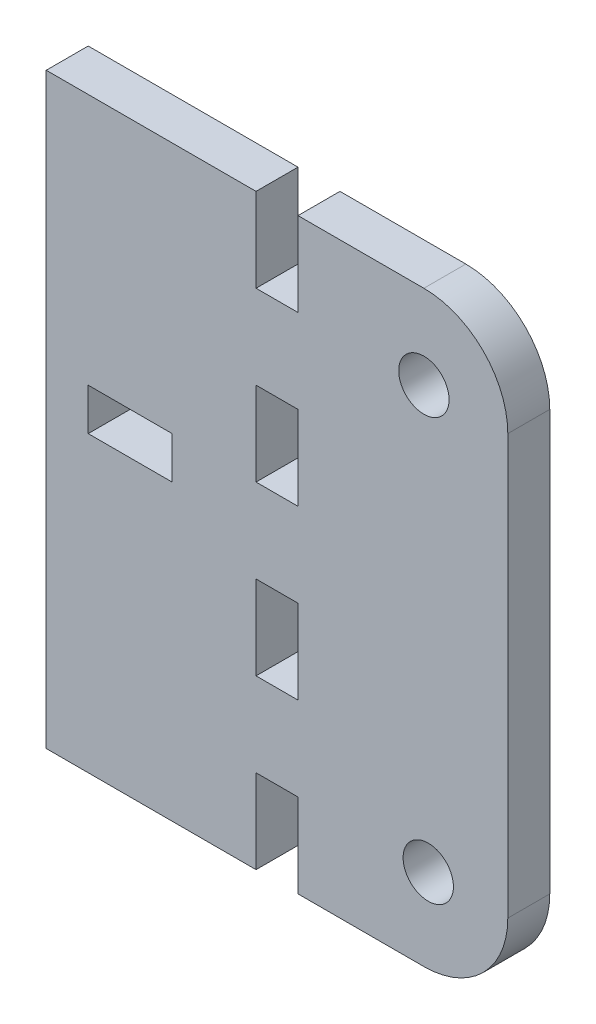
ISO-10303-21;
HEADER;
FILE_DESCRIPTION(('STEP AP214'),'2;1');
FILE_NAME('part.step','',(''),(''),'','','');
FILE_SCHEMA(('AUTOMOTIVE_DESIGN { 1 0 10303 214 1 1 1 1 }'));
ENDSEC;
DATA;
#1=APPLICATION_CONTEXT('core data for automotive mechanical design processes');
#2=APPLICATION_PROTOCOL_DEFINITION('international standard','automotive_design',2000,#1);
#3=PRODUCT_CONTEXT('',#1,'mechanical');
#4=PRODUCT('Part','Part','',(#3));
#5=PRODUCT_RELATED_PRODUCT_CATEGORY('part','',(#4));
#6=PRODUCT_DEFINITION_FORMATION('','',#4);
#7=PRODUCT_DEFINITION_CONTEXT('part definition',#1,'design');
#8=PRODUCT_DEFINITION('design','',#6,#7);
#9=PRODUCT_DEFINITION_SHAPE('','',#8);
#10=(LENGTH_UNIT() NAMED_UNIT(*) SI_UNIT(.MILLI.,.METRE.));
#11=(NAMED_UNIT(*) PLANE_ANGLE_UNIT() SI_UNIT($,.RADIAN.));
#12=(NAMED_UNIT(*) SI_UNIT($,.STERADIAN.) SOLID_ANGLE_UNIT());
#13=UNCERTAINTY_MEASURE_WITH_UNIT(LENGTH_MEASURE(1.E-05),#10,'distance_accuracy_value','');
#14=(GEOMETRIC_REPRESENTATION_CONTEXT(3) GLOBAL_UNCERTAINTY_ASSIGNED_CONTEXT((#13)) GLOBAL_UNIT_ASSIGNED_CONTEXT((#10,
#11,#12)) REPRESENTATION_CONTEXT('',''));
#15=CARTESIAN_POINT('',(0.,0.,0.));
#16=DIRECTION('',(0.,0.,1.));
#17=DIRECTION('',(1.,0.,0.));
#18=AXIS2_PLACEMENT_3D('',#15,#16,#17);
#19=CARTESIAN_POINT('',(0.,35.,5.));
#20=DIRECTION('',(0.,-1.,0.));
#21=DIRECTION('',(1.,0.,0.));
#22=AXIS2_PLACEMENT_3D('',#19,#20,#21);
#23=PLANE('',#22);
#24=DIRECTION('',(-1.,0.,0.));
#25=VECTOR('',#24,1.);
#26=CARTESIAN_POINT('',(0.,35.,5.));
#27=LINE('',#26,#25);
#28=CARTESIAN_POINT('',(-5.,35.,5.));
#29=VERTEX_POINT('',#28);
#30=CARTESIAN_POINT('',(-30.,35.,5.));
#31=VERTEX_POINT('',#30);
#32=EDGE_CURVE('E348',#29,#31,#27,.T.);
#33=ORIENTED_EDGE('',*,*,#32,.F.);
#34=DIRECTION('',(0.,0.,1.));
#35=VECTOR('',#34,1.);
#36=CARTESIAN_POINT('',(-5.,35.,-5.));
#37=LINE('',#36,#35);
#38=CARTESIAN_POINT('',(-5.,35.,0.));
#39=VERTEX_POINT('',#38);
#40=EDGE_CURVE('E268',#39,#29,#37,.T.);
#41=ORIENTED_EDGE('',*,*,#40,.F.);
#42=DIRECTION('',(-1.,0.,0.));
#43=VECTOR('',#42,1.);
#44=CARTESIAN_POINT('',(0.,35.,0.));
#45=LINE('',#44,#43);
#46=CARTESIAN_POINT('',(-30.,35.,0.));
#47=VERTEX_POINT('',#46);
#48=EDGE_CURVE('E341',#39,#47,#45,.T.);
#49=ORIENTED_EDGE('',*,*,#48,.T.);
#50=DIRECTION('',(0.,0.,-1.));
#51=VECTOR('',#50,1.);
#52=CARTESIAN_POINT('',(-30.,35.,5.));
#53=LINE('',#52,#51);
#54=EDGE_CURVE('E364',#31,#47,#53,.T.);
#55=ORIENTED_EDGE('',*,*,#54,.F.);
#56=EDGE_LOOP('',(#33,#41,#49,#55));
#57=FACE_BOUND('',#56,.T.);
#58=ADVANCED_FACE('F37',(#57),#23,.F.);
#59=CARTESIAN_POINT('',(-30.,-35.,5.));
#60=DIRECTION('',(1.,0.,0.));
#61=DIRECTION('',(0.,0.,-1.));
#62=AXIS2_PLACEMENT_3D('',#59,#60,#61);
#63=PLANE('',#62);
#64=DIRECTION('',(0.,-1.,0.));
#65=VECTOR('',#64,1.);
#66=CARTESIAN_POINT('',(-30.,-35.,0.));
#67=LINE('',#66,#65);
#68=CARTESIAN_POINT('',(-30.,-35.,0.));
#69=VERTEX_POINT('',#68);
#70=EDGE_CURVE('E358',#47,#69,#67,.T.);
#71=ORIENTED_EDGE('',*,*,#70,.T.);
#72=DIRECTION('',(0.,0.,-1.));
#73=VECTOR('',#72,1.);
#74=CARTESIAN_POINT('',(-30.,-35.,5.));
#75=LINE('',#74,#73);
#76=CARTESIAN_POINT('',(-30.,-35.,5.));
#77=VERTEX_POINT('',#76);
#78=EDGE_CURVE('E356',#77,#69,#75,.T.);
#79=ORIENTED_EDGE('',*,*,#78,.F.);
#80=DIRECTION('',(0.,-1.,0.));
#81=VECTOR('',#80,1.);
#82=CARTESIAN_POINT('',(-30.,-35.,5.));
#83=LINE('',#82,#81);
#84=EDGE_CURVE('E350',#31,#77,#83,.T.);
#85=ORIENTED_EDGE('',*,*,#84,.F.);
#86=ORIENTED_EDGE('',*,*,#54,.T.);
#87=EDGE_LOOP('',(#71,#79,#85,#86));
#88=FACE_BOUND('',#87,.T.);
#89=ADVANCED_FACE('F440',(#88),#63,.F.);
#90=CARTESIAN_POINT('',(0.,-35.,5.));
#91=DIRECTION('',(0.,1.,0.));
#92=DIRECTION('',(-1.,0.,0.));
#93=AXIS2_PLACEMENT_3D('',#90,#91,#92);
#94=PLANE('',#93);
#95=DIRECTION('',(1.,0.,0.));
#96=VECTOR('',#95,1.);
#97=CARTESIAN_POINT('',(0.,-35.,0.));
#98=LINE('',#97,#96);
#99=CARTESIAN_POINT('',(-5.,-35.,0.));
#100=VERTEX_POINT('',#99);
#101=EDGE_CURVE('E351',#69,#100,#98,.T.);
#102=ORIENTED_EDGE('',*,*,#101,.T.);
#103=DIRECTION('',(0.,0.,1.));
#104=VECTOR('',#103,1.);
#105=CARTESIAN_POINT('',(-5.,-35.,-5.));
#106=LINE('',#105,#104);
#107=CARTESIAN_POINT('',(-5.,-35.,5.));
#108=VERTEX_POINT('',#107);
#109=EDGE_CURVE('E309',#100,#108,#106,.T.);
#110=ORIENTED_EDGE('',*,*,#109,.T.);
#111=DIRECTION('',(1.,0.,0.));
#112=VECTOR('',#111,1.);
#113=CARTESIAN_POINT('',(0.,-35.,5.));
#114=LINE('',#113,#112);
#115=EDGE_CURVE('E353',#77,#108,#114,.T.);
#116=ORIENTED_EDGE('',*,*,#115,.F.);
#117=ORIENTED_EDGE('',*,*,#78,.T.);
#118=EDGE_LOOP('',(#102,#110,#116,#117));
#119=FACE_BOUND('',#118,.T.);
#120=ADVANCED_FACE('F444',(#119),#94,.F.);
#121=CARTESIAN_POINT('',(0.,0.,5.));
#122=DIRECTION('',(0.,0.,1.));
#123=DIRECTION('',(1.,0.,0.));
#124=AXIS2_PLACEMENT_3D('',#121,#122,#123);
#125=PLANE('',#124);
#126=CARTESIAN_POINT('',(15.5207163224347,-25.,5.));
#127=DIRECTION('',(0.,0.,1.));
#128=DIRECTION('',(1.,0.,0.));
#129=AXIS2_PLACEMENT_3D('',#126,#127,#128);
#130=CIRCLE('',#129,3.);
#131=CARTESIAN_POINT('',(18.5207163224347,-25.,5.));
#132=VERTEX_POINT('',#131);
#133=EDGE_CURVE('E459',#132,#132,#130,.T.);
#134=ORIENTED_EDGE('',*,*,#133,.F.);
#135=EDGE_LOOP('',(#134));
#136=FACE_BOUND('',#135,.T.);
#137=CARTESIAN_POINT('',(15.,25.,5.));
#138=DIRECTION('',(0.,0.,1.));
#139=DIRECTION('',(1.,0.,0.));
#140=AXIS2_PLACEMENT_3D('',#137,#138,#139);
#141=CIRCLE('',#140,3.);
#142=CARTESIAN_POINT('',(18.,25.,5.));
#143=VERTEX_POINT('',#142);
#144=EDGE_CURVE('E453',#143,#143,#141,.T.);
#145=ORIENTED_EDGE('',*,*,#144,.F.);
#146=EDGE_LOOP('',(#145));
#147=FACE_BOUND('',#146,.T.);
#148=DIRECTION('',(0.,-1.,0.));
#149=VECTOR('',#148,1.);
#150=CARTESIAN_POINT('',(0.,35.,5.));
#151=LINE('',#150,#149);
#152=CARTESIAN_POINT('',(0.,-5.,5.));
#153=VERTEX_POINT('',#152);
#154=CARTESIAN_POINT('',(0.,-15.,5.));
#155=VERTEX_POINT('',#154);
#156=EDGE_CURVE('E233',#153,#155,#151,.T.);
#157=ORIENTED_EDGE('',*,*,#156,.T.);
#158=DIRECTION('',(1.,0.,0.));
#159=VECTOR('',#158,1.);
#160=CARTESIAN_POINT('',(0.,-15.,5.));
#161=LINE('',#160,#159);
#162=CARTESIAN_POINT('',(-5.,-15.,5.));
#163=VERTEX_POINT('',#162);
#164=EDGE_CURVE('E282',#163,#155,#161,.T.);
#165=ORIENTED_EDGE('',*,*,#164,.F.);
#166=DIRECTION('',(0.,-1.,0.));
#167=VECTOR('',#166,1.);
#168=CARTESIAN_POINT('',(-5.,-15.,5.));
#169=LINE('',#168,#167);
#170=CARTESIAN_POINT('',(-5.,-5.,5.));
#171=VERTEX_POINT('',#170);
#172=EDGE_CURVE('E293',#171,#163,#169,.T.);
#173=ORIENTED_EDGE('',*,*,#172,.F.);
#174=DIRECTION('',(-1.,0.,0.));
#175=VECTOR('',#174,1.);
#176=CARTESIAN_POINT('',(0.,-5.,5.));
#177=LINE('',#176,#175);
#178=EDGE_CURVE('E290',#153,#171,#177,.T.);
#179=ORIENTED_EDGE('',*,*,#178,.F.);
#180=EDGE_LOOP('',(#157,#165,#173,#179));
#181=FACE_BOUND('',#180,.T.);
#182=CARTESIAN_POINT('',(0.,15.,5.));
#183=VERTEX_POINT('',#182);
#184=CARTESIAN_POINT('',(0.,5.,5.));
#185=VERTEX_POINT('',#184);
#186=EDGE_CURVE('E246',#183,#185,#151,.T.);
#187=ORIENTED_EDGE('',*,*,#186,.T.);
#188=DIRECTION('',(1.,0.,0.));
#189=VECTOR('',#188,1.);
#190=CARTESIAN_POINT('',(0.,5.,5.));
#191=LINE('',#190,#189);
#192=CARTESIAN_POINT('',(-5.,5.,5.));
#193=VERTEX_POINT('',#192);
#194=EDGE_CURVE('E267',#193,#185,#191,.T.);
#195=ORIENTED_EDGE('',*,*,#194,.F.);
#196=DIRECTION('',(0.,-1.,0.));
#197=VECTOR('',#196,1.);
#198=CARTESIAN_POINT('',(-5.,5.,5.));
#199=LINE('',#198,#197);
#200=CARTESIAN_POINT('',(-5.,15.,5.));
#201=VERTEX_POINT('',#200);
#202=EDGE_CURVE('E276',#201,#193,#199,.T.);
#203=ORIENTED_EDGE('',*,*,#202,.F.);
#204=DIRECTION('',(-1.,0.,0.));
#205=VECTOR('',#204,1.);
#206=CARTESIAN_POINT('',(0.,15.,5.));
#207=LINE('',#206,#205);
#208=EDGE_CURVE('E273',#183,#201,#207,.T.);
#209=ORIENTED_EDGE('',*,*,#208,.F.);
#210=EDGE_LOOP('',(#187,#195,#203,#209));
#211=FACE_BOUND('',#210,.T.);
#212=DIRECTION('',(0.,-1.,0.));
#213=VECTOR('',#212,1.);
#214=CARTESIAN_POINT('',(25.,35.,5.));
#215=LINE('',#214,#213);
#216=CARTESIAN_POINT('',(25.,25.,5.));
#217=VERTEX_POINT('',#216);
#218=CARTESIAN_POINT('',(25.,-25.,5.));
#219=VERTEX_POINT('',#218);
#220=EDGE_CURVE('E253',#217,#219,#215,.T.);
#221=ORIENTED_EDGE('',*,*,#220,.F.);
#222=CARTESIAN_POINT('',(15.,25.,5.));
#223=DIRECTION('',(0.,0.,1.));
#224=DIRECTION('',(1.,0.,0.));
#225=AXIS2_PLACEMENT_3D('',#222,#223,#224);
#226=CIRCLE('',#225,10.);
#227=CARTESIAN_POINT('',(15.,35.,5.));
#228=VERTEX_POINT('',#227);
#229=EDGE_CURVE('E405',#217,#228,#226,.T.);
#230=ORIENTED_EDGE('',*,*,#229,.T.);
#231=DIRECTION('',(-1.,0.,0.));
#232=VECTOR('',#231,1.);
#233=CARTESIAN_POINT('',(25.,35.,5.));
#234=LINE('',#233,#232);
#235=CARTESIAN_POINT('',(0.,35.,5.));
#236=VERTEX_POINT('',#235);
#237=EDGE_CURVE('E254',#228,#236,#234,.T.);
#238=ORIENTED_EDGE('',*,*,#237,.T.);
#239=CARTESIAN_POINT('',(0.,25.,5.));
#240=VERTEX_POINT('',#239);
#241=EDGE_CURVE('E236',#236,#240,#151,.T.);
#242=ORIENTED_EDGE('',*,*,#241,.T.);
#243=DIRECTION('',(1.,0.,0.));
#244=VECTOR('',#243,1.);
#245=CARTESIAN_POINT('',(0.,25.,5.));
#246=LINE('',#245,#244);
#247=CARTESIAN_POINT('',(-5.,25.,5.));
#248=VERTEX_POINT('',#247);
#249=EDGE_CURVE('E219',#248,#240,#246,.T.);
#250=ORIENTED_EDGE('',*,*,#249,.F.);
#251=DIRECTION('',(0.,-1.,0.));
#252=VECTOR('',#251,1.);
#253=CARTESIAN_POINT('',(-5.,25.,5.));
#254=LINE('',#253,#252);
#255=EDGE_CURVE('E261',#29,#248,#254,.T.);
#256=ORIENTED_EDGE('',*,*,#255,.F.);
#257=ORIENTED_EDGE('',*,*,#32,.T.);
#258=ORIENTED_EDGE('',*,*,#84,.T.);
#259=ORIENTED_EDGE('',*,*,#115,.T.);
#260=DIRECTION('',(0.,-1.,0.));
#261=VECTOR('',#260,1.);
#262=CARTESIAN_POINT('',(-5.,-35.,5.));
#263=LINE('',#262,#261);
#264=CARTESIAN_POINT('',(-5.,-25.,5.));
#265=VERTEX_POINT('',#264);
#266=EDGE_CURVE('E306',#265,#108,#263,.T.);
#267=ORIENTED_EDGE('',*,*,#266,.F.);
#268=DIRECTION('',(-1.,0.,0.));
#269=VECTOR('',#268,1.);
#270=CARTESIAN_POINT('',(0.,-25.,5.));
#271=LINE('',#270,#269);
#272=CARTESIAN_POINT('',(0.,-25.,5.));
#273=VERTEX_POINT('',#272);
#274=EDGE_CURVE('E230',#273,#265,#271,.T.);
#275=ORIENTED_EDGE('',*,*,#274,.F.);
#276=CARTESIAN_POINT('',(0.,-35.,5.));
#277=VERTEX_POINT('',#276);
#278=EDGE_CURVE('E224',#273,#277,#151,.T.);
#279=ORIENTED_EDGE('',*,*,#278,.T.);
#280=DIRECTION('',(-1.,0.,0.));
#281=VECTOR('',#280,1.);
#282=CARTESIAN_POINT('',(25.,-35.,5.));
#283=LINE('',#282,#281);
#284=CARTESIAN_POINT('',(15.,-35.,5.));
#285=VERTEX_POINT('',#284);
#286=EDGE_CURVE('E210',#285,#277,#283,.T.);
#287=ORIENTED_EDGE('',*,*,#286,.F.);
#288=CARTESIAN_POINT('',(15.,-25.,5.));
#289=DIRECTION('',(0.,0.,1.));
#290=DIRECTION('',(1.,0.,0.));
#291=AXIS2_PLACEMENT_3D('',#288,#289,#290);
#292=CIRCLE('',#291,10.);
#293=EDGE_CURVE('E403',#285,#219,#292,.T.);
#294=ORIENTED_EDGE('',*,*,#293,.T.);
#295=EDGE_LOOP('',(#221,#230,#238,#242,#250,#256,#257,#258,#259,#267,#275,#279,#287,#294));
#296=FACE_BOUND('',#295,.T.);
#297=DIRECTION('',(0.,1.,0.));
#298=VECTOR('',#297,1.);
#299=CARTESIAN_POINT('',(-15.,0.,5.));
#300=LINE('',#299,#298);
#301=CARTESIAN_POINT('',(-15.,0.,5.));
#302=VERTEX_POINT('',#301);
#303=CARTESIAN_POINT('',(-15.,5.,5.));
#304=VERTEX_POINT('',#303);
#305=EDGE_CURVE('E312',#302,#304,#300,.T.);
#306=ORIENTED_EDGE('',*,*,#305,.F.);
#307=DIRECTION('',(1.,0.,0.));
#308=VECTOR('',#307,1.);
#309=CARTESIAN_POINT('',(-15.,0.,5.));
#310=LINE('',#309,#308);
#311=CARTESIAN_POINT('',(-25.,0.,5.));
#312=VERTEX_POINT('',#311);
#313=EDGE_CURVE('E320',#312,#302,#310,.T.);
#314=ORIENTED_EDGE('',*,*,#313,.F.);
#315=DIRECTION('',(0.,-1.,0.));
#316=VECTOR('',#315,1.);
#317=CARTESIAN_POINT('',(-25.,0.,5.));
#318=LINE('',#317,#316);
#319=CARTESIAN_POINT('',(-25.,5.,5.));
#320=VERTEX_POINT('',#319);
#321=EDGE_CURVE('E334',#320,#312,#318,.T.);
#322=ORIENTED_EDGE('',*,*,#321,.F.);
#323=DIRECTION('',(-1.,0.,0.));
#324=VECTOR('',#323,1.);
#325=CARTESIAN_POINT('',(-15.,5.,5.));
#326=LINE('',#325,#324);
#327=EDGE_CURVE('E331',#304,#320,#326,.T.);
#328=ORIENTED_EDGE('',*,*,#327,.F.);
#329=EDGE_LOOP('',(#306,#314,#322,#328));
#330=FACE_BOUND('',#329,.T.);
#331=ADVANCED_FACE('F226',(#136,#147,#181,#211,#296,#330),#125,.T.);
#332=CARTESIAN_POINT('',(0.,0.,0.));
#333=DIRECTION('',(0.,0.,1.));
#334=DIRECTION('',(1.,0.,0.));
#335=AXIS2_PLACEMENT_3D('',#332,#333,#334);
#336=PLANE('',#335);
#337=CARTESIAN_POINT('',(15.5207163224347,-25.,0.));
#338=DIRECTION('',(0.,0.,1.));
#339=DIRECTION('',(1.,0.,0.));
#340=AXIS2_PLACEMENT_3D('',#337,#338,#339);
#341=CIRCLE('',#340,3.);
#342=CARTESIAN_POINT('',(18.5207163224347,-25.,0.));
#343=VERTEX_POINT('',#342);
#344=EDGE_CURVE('E456',#343,#343,#341,.T.);
#345=ORIENTED_EDGE('',*,*,#344,.T.);
#346=EDGE_LOOP('',(#345));
#347=FACE_BOUND('',#346,.T.);
#348=CARTESIAN_POINT('',(15.,25.,0.));
#349=DIRECTION('',(0.,0.,1.));
#350=DIRECTION('',(1.,0.,0.));
#351=AXIS2_PLACEMENT_3D('',#348,#349,#350);
#352=CIRCLE('',#351,3.);
#353=CARTESIAN_POINT('',(18.,25.,0.));
#354=VERTEX_POINT('',#353);
#355=EDGE_CURVE('E234',#354,#354,#352,.T.);
#356=ORIENTED_EDGE('',*,*,#355,.T.);
#357=EDGE_LOOP('',(#356));
#358=FACE_BOUND('',#357,.T.);
#359=DIRECTION('',(1.,0.,0.));
#360=VECTOR('',#359,1.);
#361=CARTESIAN_POINT('',(0.,-15.,0.));
#362=LINE('',#361,#360);
#363=CARTESIAN_POINT('',(-5.,-15.,0.));
#364=VERTEX_POINT('',#363);
#365=CARTESIAN_POINT('',(0.,-15.,0.));
#366=VERTEX_POINT('',#365);
#367=EDGE_CURVE('E379',#364,#366,#362,.T.);
#368=ORIENTED_EDGE('',*,*,#367,.T.);
#369=DIRECTION('',(0.,1.,0.));
#370=VECTOR('',#369,1.);
#371=CARTESIAN_POINT('',(0.,35.,0.));
#372=LINE('',#371,#370);
#373=CARTESIAN_POINT('',(0.,-5.,0.));
#374=VERTEX_POINT('',#373);
#375=EDGE_CURVE('E250',#366,#374,#372,.T.);
#376=ORIENTED_EDGE('',*,*,#375,.T.);
#377=DIRECTION('',(-1.,0.,0.));
#378=VECTOR('',#377,1.);
#379=CARTESIAN_POINT('',(0.,-5.,0.));
#380=LINE('',#379,#378);
#381=CARTESIAN_POINT('',(-5.,-5.,0.));
#382=VERTEX_POINT('',#381);
#383=EDGE_CURVE('E373',#374,#382,#380,.T.);
#384=ORIENTED_EDGE('',*,*,#383,.T.);
#385=DIRECTION('',(0.,-1.,0.));
#386=VECTOR('',#385,1.);
#387=CARTESIAN_POINT('',(-5.,0.,0.));
#388=LINE('',#387,#386);
#389=EDGE_CURVE('E376',#382,#364,#388,.T.);
#390=ORIENTED_EDGE('',*,*,#389,.T.);
#391=EDGE_LOOP('',(#368,#376,#384,#390));
#392=FACE_BOUND('',#391,.T.);
#393=DIRECTION('',(1.,0.,0.));
#394=VECTOR('',#393,1.);
#395=CARTESIAN_POINT('',(0.,5.,0.));
#396=LINE('',#395,#394);
#397=CARTESIAN_POINT('',(-5.,5.,0.));
#398=VERTEX_POINT('',#397);
#399=CARTESIAN_POINT('',(0.,5.,0.));
#400=VERTEX_POINT('',#399);
#401=EDGE_CURVE('E388',#398,#400,#396,.T.);
#402=ORIENTED_EDGE('',*,*,#401,.T.);
#403=CARTESIAN_POINT('',(0.,15.,0.));
#404=VERTEX_POINT('',#403);
#405=EDGE_CURVE('E243',#400,#404,#372,.T.);
#406=ORIENTED_EDGE('',*,*,#405,.T.);
#407=DIRECTION('',(-1.,0.,0.));
#408=VECTOR('',#407,1.);
#409=CARTESIAN_POINT('',(0.,15.,0.));
#410=LINE('',#409,#408);
#411=CARTESIAN_POINT('',(-5.,15.,0.));
#412=VERTEX_POINT('',#411);
#413=EDGE_CURVE('E382',#404,#412,#410,.T.);
#414=ORIENTED_EDGE('',*,*,#413,.T.);
#415=DIRECTION('',(0.,-1.,0.));
#416=VECTOR('',#415,1.);
#417=CARTESIAN_POINT('',(-5.,0.,0.));
#418=LINE('',#417,#416);
#419=EDGE_CURVE('E385',#412,#398,#418,.T.);
#420=ORIENTED_EDGE('',*,*,#419,.T.);
#421=EDGE_LOOP('',(#402,#406,#414,#420));
#422=FACE_BOUND('',#421,.T.);
#423=DIRECTION('',(1.,0.,0.));
#424=VECTOR('',#423,1.);
#425=CARTESIAN_POINT('',(-15.,0.,0.));
#426=LINE('',#425,#424);
#427=CARTESIAN_POINT('',(-25.,0.,0.));
#428=VERTEX_POINT('',#427);
#429=CARTESIAN_POINT('',(-15.,0.,0.));
#430=VERTEX_POINT('',#429);
#431=EDGE_CURVE('E326',#428,#430,#426,.T.);
#432=ORIENTED_EDGE('',*,*,#431,.T.);
#433=DIRECTION('',(0.,1.,0.));
#434=VECTOR('',#433,1.);
#435=CARTESIAN_POINT('',(-15.,0.,0.));
#436=LINE('',#435,#434);
#437=CARTESIAN_POINT('',(-15.,5.,0.));
#438=VERTEX_POINT('',#437);
#439=EDGE_CURVE('E316',#430,#438,#436,.T.);
#440=ORIENTED_EDGE('',*,*,#439,.T.);
#441=DIRECTION('',(-1.,0.,0.));
#442=VECTOR('',#441,1.);
#443=CARTESIAN_POINT('',(-15.,5.,0.));
#444=LINE('',#443,#442);
#445=CARTESIAN_POINT('',(-25.,5.,0.));
#446=VERTEX_POINT('',#445);
#447=EDGE_CURVE('E319',#438,#446,#444,.T.);
#448=ORIENTED_EDGE('',*,*,#447,.T.);
#449=DIRECTION('',(0.,-1.,0.));
#450=VECTOR('',#449,1.);
#451=CARTESIAN_POINT('',(-25.,0.,0.));
#452=LINE('',#451,#450);
#453=EDGE_CURVE('E323',#446,#428,#452,.T.);
#454=ORIENTED_EDGE('',*,*,#453,.T.);
#455=EDGE_LOOP('',(#432,#440,#448,#454));
#456=FACE_BOUND('',#455,.T.);
#457=DIRECTION('',(-1.,0.,0.));
#458=VECTOR('',#457,1.);
#459=CARTESIAN_POINT('',(25.,35.,0.));
#460=LINE('',#459,#458);
#461=CARTESIAN_POINT('',(15.,35.,0.));
#462=VERTEX_POINT('',#461);
#463=CARTESIAN_POINT('',(0.,35.,0.));
#464=VERTEX_POINT('',#463);
#465=EDGE_CURVE('E256',#462,#464,#460,.T.);
#466=ORIENTED_EDGE('',*,*,#465,.F.);
#467=CARTESIAN_POINT('',(15.,25.,0.));
#468=DIRECTION('',(0.,0.,1.));
#469=DIRECTION('',(1.,0.,0.));
#470=AXIS2_PLACEMENT_3D('',#467,#468,#469);
#471=CIRCLE('',#470,10.);
#472=CARTESIAN_POINT('',(25.,25.,0.));
#473=VERTEX_POINT('',#472);
#474=EDGE_CURVE('E45',#462,#473,#471,.F.);
#475=ORIENTED_EDGE('',*,*,#474,.T.);
#476=DIRECTION('',(0.,1.,0.));
#477=VECTOR('',#476,1.);
#478=CARTESIAN_POINT('',(25.,35.,0.));
#479=LINE('',#478,#477);
#480=CARTESIAN_POINT('',(25.,-25.,0.));
#481=VERTEX_POINT('',#480);
#482=EDGE_CURVE('E257',#481,#473,#479,.T.);
#483=ORIENTED_EDGE('',*,*,#482,.F.);
#484=CARTESIAN_POINT('',(15.,-25.,0.));
#485=DIRECTION('',(0.,0.,1.));
#486=DIRECTION('',(1.,0.,0.));
#487=AXIS2_PLACEMENT_3D('',#484,#485,#486);
#488=CIRCLE('',#487,10.);
#489=CARTESIAN_POINT('',(15.,-35.,0.));
#490=VERTEX_POINT('',#489);
#491=EDGE_CURVE('E52',#481,#490,#488,.F.);
#492=ORIENTED_EDGE('',*,*,#491,.T.);
#493=DIRECTION('',(-1.,0.,0.));
#494=VECTOR('',#493,1.);
#495=CARTESIAN_POINT('',(25.,-35.,0.));
#496=LINE('',#495,#494);
#497=CARTESIAN_POINT('',(0.,-35.,0.));
#498=VERTEX_POINT('',#497);
#499=EDGE_CURVE('E220',#490,#498,#496,.T.);
#500=ORIENTED_EDGE('',*,*,#499,.T.);
#501=CARTESIAN_POINT('',(0.,-25.,0.));
#502=VERTEX_POINT('',#501);
#503=EDGE_CURVE('E239',#498,#502,#372,.T.);
#504=ORIENTED_EDGE('',*,*,#503,.T.);
#505=DIRECTION('',(-1.,0.,0.));
#506=VECTOR('',#505,1.);
#507=CARTESIAN_POINT('',(0.,-25.,0.));
#508=LINE('',#507,#506);
#509=CARTESIAN_POINT('',(-5.,-25.,0.));
#510=VERTEX_POINT('',#509);
#511=EDGE_CURVE('E367',#502,#510,#508,.T.);
#512=ORIENTED_EDGE('',*,*,#511,.T.);
#513=DIRECTION('',(0.,-1.,0.));
#514=VECTOR('',#513,1.);
#515=CARTESIAN_POINT('',(-5.,0.,0.));
#516=LINE('',#515,#514);
#517=EDGE_CURVE('E370',#510,#100,#516,.T.);
#518=ORIENTED_EDGE('',*,*,#517,.T.);
#519=ORIENTED_EDGE('',*,*,#101,.F.);
#520=ORIENTED_EDGE('',*,*,#70,.F.);
#521=ORIENTED_EDGE('',*,*,#48,.F.);
#522=DIRECTION('',(0.,-1.,0.));
#523=VECTOR('',#522,1.);
#524=CARTESIAN_POINT('',(-5.,0.,0.));
#525=LINE('',#524,#523);
#526=CARTESIAN_POINT('',(-5.,25.,0.));
#527=VERTEX_POINT('',#526);
#528=EDGE_CURVE('E391',#39,#527,#525,.T.);
#529=ORIENTED_EDGE('',*,*,#528,.T.);
#530=DIRECTION('',(1.,0.,0.));
#531=VECTOR('',#530,1.);
#532=CARTESIAN_POINT('',(0.,25.,0.));
#533=LINE('',#532,#531);
#534=CARTESIAN_POINT('',(0.,25.,0.));
#535=VERTEX_POINT('',#534);
#536=EDGE_CURVE('E394',#527,#535,#533,.T.);
#537=ORIENTED_EDGE('',*,*,#536,.T.);
#538=EDGE_CURVE('E240',#535,#464,#372,.T.);
#539=ORIENTED_EDGE('',*,*,#538,.T.);
#540=EDGE_LOOP('',(#466,#475,#483,#492,#500,#504,#512,#518,#519,#520,#521,#529,#537,#539));
#541=FACE_BOUND('',#540,.T.);
#542=ADVANCED_FACE('F410',(#347,#358,#392,#422,#456,#541),#336,.F.);
#543=CARTESIAN_POINT('',(-15.,0.,0.));
#544=DIRECTION('',(1.,0.,0.));
#545=DIRECTION('',(0.,0.,-1.));
#546=AXIS2_PLACEMENT_3D('',#543,#544,#545);
#547=PLANE('',#546);
#548=ORIENTED_EDGE('',*,*,#305,.T.);
#549=DIRECTION('',(0.,0.,1.));
#550=VECTOR('',#549,1.);
#551=CARTESIAN_POINT('',(-15.,5.,0.));
#552=LINE('',#551,#550);
#553=EDGE_CURVE('E329',#438,#304,#552,.T.);
#554=ORIENTED_EDGE('',*,*,#553,.F.);
#555=ORIENTED_EDGE('',*,*,#439,.F.);
#556=DIRECTION('',(0.,0.,1.));
#557=VECTOR('',#556,1.);
#558=CARTESIAN_POINT('',(-15.,0.,0.));
#559=LINE('',#558,#557);
#560=EDGE_CURVE('E339',#430,#302,#559,.T.);
#561=ORIENTED_EDGE('',*,*,#560,.T.);
#562=EDGE_LOOP('',(#548,#554,#555,#561));
#563=FACE_BOUND('',#562,.T.);
#564=ADVANCED_FACE('F568',(#563),#547,.F.);
#565=CARTESIAN_POINT('',(-15.,0.,0.));
#566=DIRECTION('',(0.,-1.,0.));
#567=DIRECTION('',(0.,0.,-1.));
#568=AXIS2_PLACEMENT_3D('',#565,#566,#567);
#569=PLANE('',#568);
#570=ORIENTED_EDGE('',*,*,#313,.T.);
#571=ORIENTED_EDGE('',*,*,#560,.F.);
#572=ORIENTED_EDGE('',*,*,#431,.F.);
#573=DIRECTION('',(0.,0.,1.));
#574=VECTOR('',#573,1.);
#575=CARTESIAN_POINT('',(-25.,0.,0.));
#576=LINE('',#575,#574);
#577=EDGE_CURVE('E342',#428,#312,#576,.T.);
#578=ORIENTED_EDGE('',*,*,#577,.T.);
#579=EDGE_LOOP('',(#570,#571,#572,#578));
#580=FACE_BOUND('',#579,.T.);
#581=ADVANCED_FACE('F727',(#580),#569,.F.);
#582=CARTESIAN_POINT('',(-25.,0.,0.));
#583=DIRECTION('',(-1.,0.,0.));
#584=DIRECTION('',(0.,0.,1.));
#585=AXIS2_PLACEMENT_3D('',#582,#583,#584);
#586=PLANE('',#585);
#587=ORIENTED_EDGE('',*,*,#321,.T.);
#588=ORIENTED_EDGE('',*,*,#577,.F.);
#589=ORIENTED_EDGE('',*,*,#453,.F.);
#590=DIRECTION('',(0.,0.,1.));
#591=VECTOR('',#590,1.);
#592=CARTESIAN_POINT('',(-25.,5.,0.));
#593=LINE('',#592,#591);
#594=EDGE_CURVE('E344',#446,#320,#593,.T.);
#595=ORIENTED_EDGE('',*,*,#594,.T.);
#596=EDGE_LOOP('',(#587,#588,#589,#595));
#597=FACE_BOUND('',#596,.T.);
#598=ADVANCED_FACE('F717',(#597),#586,.F.);
#599=CARTESIAN_POINT('',(-15.,5.,0.));
#600=DIRECTION('',(0.,1.,0.));
#601=DIRECTION('',(-1.,0.,0.));
#602=AXIS2_PLACEMENT_3D('',#599,#600,#601);
#603=PLANE('',#602);
#604=ORIENTED_EDGE('',*,*,#327,.T.);
#605=ORIENTED_EDGE('',*,*,#594,.F.);
#606=ORIENTED_EDGE('',*,*,#447,.F.);
#607=ORIENTED_EDGE('',*,*,#553,.T.);
#608=EDGE_LOOP('',(#604,#605,#606,#607));
#609=FACE_BOUND('',#608,.T.);
#610=ADVANCED_FACE('F697',(#609),#603,.F.);
#611=CARTESIAN_POINT('',(-5.,-35.,-5.));
#612=DIRECTION('',(-1.,0.,0.));
#613=DIRECTION('',(0.,-1.,0.));
#614=AXIS2_PLACEMENT_3D('',#611,#612,#613);
#615=PLANE('',#614);
#616=DIRECTION('',(0.,0.,1.));
#617=VECTOR('',#616,1.);
#618=CARTESIAN_POINT('',(-5.,-25.,-5.));
#619=LINE('',#618,#617);
#620=EDGE_CURVE('E313',#510,#265,#619,.T.);
#621=ORIENTED_EDGE('',*,*,#620,.T.);
#622=ORIENTED_EDGE('',*,*,#266,.T.);
#623=ORIENTED_EDGE('',*,*,#109,.F.);
#624=ORIENTED_EDGE('',*,*,#517,.F.);
#625=EDGE_LOOP('',(#621,#622,#623,#624));
#626=FACE_BOUND('',#625,.T.);
#627=ADVANCED_FACE('F446',(#626),#615,.F.);
#628=CARTESIAN_POINT('',(0.,-25.,-5.));
#629=DIRECTION('',(0.,1.,0.));
#630=DIRECTION('',(0.,0.,1.));
#631=AXIS2_PLACEMENT_3D('',#628,#629,#630);
#632=PLANE('',#631);
#633=DIRECTION('',(0.,0.,1.));
#634=VECTOR('',#633,1.);
#635=CARTESIAN_POINT('',(0.,-25.,-5.));
#636=LINE('',#635,#634);
#637=EDGE_CURVE('E308',#502,#273,#636,.T.);
#638=ORIENTED_EDGE('',*,*,#637,.T.);
#639=ORIENTED_EDGE('',*,*,#274,.T.);
#640=ORIENTED_EDGE('',*,*,#620,.F.);
#641=ORIENTED_EDGE('',*,*,#511,.F.);
#642=EDGE_LOOP('',(#638,#639,#640,#641));
#643=FACE_BOUND('',#642,.T.);
#644=ADVANCED_FACE('F449',(#643),#632,.F.);
#645=CARTESIAN_POINT('',(0.,-15.,-5.));
#646=DIRECTION('',(0.,-1.,0.));
#647=DIRECTION('',(0.,0.,-1.));
#648=AXIS2_PLACEMENT_3D('',#645,#646,#647);
#649=PLANE('',#648);
#650=DIRECTION('',(0.,0.,1.));
#651=VECTOR('',#650,1.);
#652=CARTESIAN_POINT('',(-5.,-15.,-5.));
#653=LINE('',#652,#651);
#654=EDGE_CURVE('E297',#364,#163,#653,.T.);
#655=ORIENTED_EDGE('',*,*,#654,.T.);
#656=ORIENTED_EDGE('',*,*,#164,.T.);
#657=DIRECTION('',(0.,0.,1.));
#658=VECTOR('',#657,1.);
#659=CARTESIAN_POINT('',(0.,-15.,-5.));
#660=LINE('',#659,#658);
#661=EDGE_CURVE('E296',#366,#155,#660,.T.);
#662=ORIENTED_EDGE('',*,*,#661,.F.);
#663=ORIENTED_EDGE('',*,*,#367,.F.);
#664=EDGE_LOOP('',(#655,#656,#662,#663));
#665=FACE_BOUND('',#664,.T.);
#666=ADVANCED_FACE('F657',(#665),#649,.F.);
#667=CARTESIAN_POINT('',(-5.,-15.,-5.));
#668=DIRECTION('',(-1.,0.,0.));
#669=DIRECTION('',(0.,-1.,0.));
#670=AXIS2_PLACEMENT_3D('',#667,#668,#669);
#671=PLANE('',#670);
#672=DIRECTION('',(0.,0.,1.));
#673=VECTOR('',#672,1.);
#674=CARTESIAN_POINT('',(-5.,-5.,-5.));
#675=LINE('',#674,#673);
#676=EDGE_CURVE('E299',#382,#171,#675,.T.);
#677=ORIENTED_EDGE('',*,*,#676,.T.);
#678=ORIENTED_EDGE('',*,*,#172,.T.);
#679=ORIENTED_EDGE('',*,*,#654,.F.);
#680=ORIENTED_EDGE('',*,*,#389,.F.);
#681=EDGE_LOOP('',(#677,#678,#679,#680));
#682=FACE_BOUND('',#681,.T.);
#683=ADVANCED_FACE('F649',(#682),#671,.F.);
#684=CARTESIAN_POINT('',(0.,-5.,-5.));
#685=DIRECTION('',(0.,1.,0.));
#686=DIRECTION('',(0.,0.,1.));
#687=AXIS2_PLACEMENT_3D('',#684,#685,#686);
#688=PLANE('',#687);
#689=DIRECTION('',(0.,0.,1.));
#690=VECTOR('',#689,1.);
#691=CARTESIAN_POINT('',(0.,-5.,-5.));
#692=LINE('',#691,#690);
#693=EDGE_CURVE('E301',#374,#153,#692,.T.);
#694=ORIENTED_EDGE('',*,*,#693,.T.);
#695=ORIENTED_EDGE('',*,*,#178,.T.);
#696=ORIENTED_EDGE('',*,*,#676,.F.);
#697=ORIENTED_EDGE('',*,*,#383,.F.);
#698=EDGE_LOOP('',(#694,#695,#696,#697));
#699=FACE_BOUND('',#698,.T.);
#700=ADVANCED_FACE('F641',(#699),#688,.F.);
#701=CARTESIAN_POINT('',(0.,5.,-5.));
#702=DIRECTION('',(0.,-1.,0.));
#703=DIRECTION('',(0.,0.,-1.));
#704=AXIS2_PLACEMENT_3D('',#701,#702,#703);
#705=PLANE('',#704);
#706=DIRECTION('',(0.,0.,1.));
#707=VECTOR('',#706,1.);
#708=CARTESIAN_POINT('',(-5.,5.,-5.));
#709=LINE('',#708,#707);
#710=EDGE_CURVE('E280',#398,#193,#709,.T.);
#711=ORIENTED_EDGE('',*,*,#710,.T.);
#712=ORIENTED_EDGE('',*,*,#194,.T.);
#713=DIRECTION('',(0.,0.,1.));
#714=VECTOR('',#713,1.);
#715=CARTESIAN_POINT('',(0.,5.,-5.));
#716=LINE('',#715,#714);
#717=EDGE_CURVE('E279',#400,#185,#716,.T.);
#718=ORIENTED_EDGE('',*,*,#717,.F.);
#719=ORIENTED_EDGE('',*,*,#401,.F.);
#720=EDGE_LOOP('',(#711,#712,#718,#719));
#721=FACE_BOUND('',#720,.T.);
#722=ADVANCED_FACE('F495',(#721),#705,.F.);
#723=CARTESIAN_POINT('',(-5.,5.,-5.));
#724=DIRECTION('',(-1.,0.,0.));
#725=DIRECTION('',(0.,-1.,0.));
#726=AXIS2_PLACEMENT_3D('',#723,#724,#725);
#727=PLANE('',#726);
#728=DIRECTION('',(0.,0.,1.));
#729=VECTOR('',#728,1.);
#730=CARTESIAN_POINT('',(-5.,15.,-5.));
#731=LINE('',#730,#729);
#732=EDGE_CURVE('E283',#412,#201,#731,.T.);
#733=ORIENTED_EDGE('',*,*,#732,.T.);
#734=ORIENTED_EDGE('',*,*,#202,.T.);
#735=ORIENTED_EDGE('',*,*,#710,.F.);
#736=ORIENTED_EDGE('',*,*,#419,.F.);
#737=EDGE_LOOP('',(#733,#734,#735,#736));
#738=FACE_BOUND('',#737,.T.);
#739=ADVANCED_FACE('F501',(#738),#727,.F.);
#740=CARTESIAN_POINT('',(0.,15.,-5.));
#741=DIRECTION('',(0.,1.,0.));
#742=DIRECTION('',(0.,0.,1.));
#743=AXIS2_PLACEMENT_3D('',#740,#741,#742);
#744=PLANE('',#743);
#745=DIRECTION('',(0.,0.,1.));
#746=VECTOR('',#745,1.);
#747=CARTESIAN_POINT('',(0.,15.,-5.));
#748=LINE('',#747,#746);
#749=EDGE_CURVE('E285',#404,#183,#748,.T.);
#750=ORIENTED_EDGE('',*,*,#749,.T.);
#751=ORIENTED_EDGE('',*,*,#208,.T.);
#752=ORIENTED_EDGE('',*,*,#732,.F.);
#753=ORIENTED_EDGE('',*,*,#413,.F.);
#754=EDGE_LOOP('',(#750,#751,#752,#753));
#755=FACE_BOUND('',#754,.T.);
#756=ADVANCED_FACE('F503',(#755),#744,.F.);
#757=CARTESIAN_POINT('',(0.,25.,-5.));
#758=DIRECTION('',(0.,-1.,0.));
#759=DIRECTION('',(0.,0.,-1.));
#760=AXIS2_PLACEMENT_3D('',#757,#758,#759);
#761=PLANE('',#760);
#762=DIRECTION('',(0.,0.,1.));
#763=VECTOR('',#762,1.);
#764=CARTESIAN_POINT('',(-5.,25.,-5.));
#765=LINE('',#764,#763);
#766=EDGE_CURVE('E265',#527,#248,#765,.T.);
#767=ORIENTED_EDGE('',*,*,#766,.T.);
#768=ORIENTED_EDGE('',*,*,#249,.T.);
#769=DIRECTION('',(0.,0.,1.));
#770=VECTOR('',#769,1.);
#771=CARTESIAN_POINT('',(0.,25.,-5.));
#772=LINE('',#771,#770);
#773=EDGE_CURVE('E264',#535,#240,#772,.T.);
#774=ORIENTED_EDGE('',*,*,#773,.F.);
#775=ORIENTED_EDGE('',*,*,#536,.F.);
#776=EDGE_LOOP('',(#767,#768,#774,#775));
#777=FACE_BOUND('',#776,.T.);
#778=ADVANCED_FACE('F428',(#777),#761,.F.);
#779=CARTESIAN_POINT('',(-5.,25.,-5.));
#780=DIRECTION('',(-1.,0.,0.));
#781=DIRECTION('',(0.,-1.,0.));
#782=AXIS2_PLACEMENT_3D('',#779,#780,#781);
#783=PLANE('',#782);
#784=ORIENTED_EDGE('',*,*,#40,.T.);
#785=ORIENTED_EDGE('',*,*,#255,.T.);
#786=ORIENTED_EDGE('',*,*,#766,.F.);
#787=ORIENTED_EDGE('',*,*,#528,.F.);
#788=EDGE_LOOP('',(#784,#785,#786,#787));
#789=FACE_BOUND('',#788,.T.);
#790=ADVANCED_FACE('F431',(#789),#783,.F.);
#791=CARTESIAN_POINT('',(0.,0.,0.));
#792=DIRECTION('',(1.,0.,0.));
#793=DIRECTION('',(0.,0.,-1.));
#794=AXIS2_PLACEMENT_3D('',#791,#792,#793);
#795=PLANE('',#794);
#796=ORIENTED_EDGE('',*,*,#278,.F.);
#797=ORIENTED_EDGE('',*,*,#637,.F.);
#798=ORIENTED_EDGE('',*,*,#503,.F.);
#799=DIRECTION('',(0.,0.,-1.));
#800=VECTOR('',#799,1.);
#801=CARTESIAN_POINT('',(0.,-35.,5.));
#802=LINE('',#801,#800);
#803=EDGE_CURVE('E214',#277,#498,#802,.T.);
#804=ORIENTED_EDGE('',*,*,#803,.F.);
#805=EDGE_LOOP('',(#796,#797,#798,#804));
#806=FACE_BOUND('',#805,.T.);
#807=ADVANCED_FACE('F237',(#806),#795,.F.);
#808=ORIENTED_EDGE('',*,*,#375,.F.);
#809=ORIENTED_EDGE('',*,*,#661,.T.);
#810=ORIENTED_EDGE('',*,*,#156,.F.);
#811=ORIENTED_EDGE('',*,*,#693,.F.);
#812=EDGE_LOOP('',(#808,#809,#810,#811));
#813=FACE_BOUND('',#812,.T.);
#814=ADVANCED_FACE('F607',(#813),#795,.F.);
#815=ORIENTED_EDGE('',*,*,#405,.F.);
#816=ORIENTED_EDGE('',*,*,#717,.T.);
#817=ORIENTED_EDGE('',*,*,#186,.F.);
#818=ORIENTED_EDGE('',*,*,#749,.F.);
#819=EDGE_LOOP('',(#815,#816,#817,#818));
#820=FACE_BOUND('',#819,.T.);
#821=ADVANCED_FACE('F492',(#820),#795,.F.);
#822=ORIENTED_EDGE('',*,*,#538,.F.);
#823=ORIENTED_EDGE('',*,*,#773,.T.);
#824=ORIENTED_EDGE('',*,*,#241,.F.);
#825=DIRECTION('',(0.,0.,1.));
#826=VECTOR('',#825,1.);
#827=CARTESIAN_POINT('',(0.,35.,5.));
#828=LINE('',#827,#826);
#829=EDGE_CURVE('E249',#464,#236,#828,.T.);
#830=ORIENTED_EDGE('',*,*,#829,.F.);
#831=EDGE_LOOP('',(#822,#823,#824,#830));
#832=FACE_BOUND('',#831,.T.);
#833=ADVANCED_FACE('F423',(#832),#795,.F.);
#834=CARTESIAN_POINT('',(25.,-35.,5.));
#835=DIRECTION('',(0.,1.,0.));
#836=DIRECTION('',(0.,0.,1.));
#837=AXIS2_PLACEMENT_3D('',#834,#835,#836);
#838=PLANE('',#837);
#839=ORIENTED_EDGE('',*,*,#499,.F.);
#840=DIRECTION('',(0.,0.,-1.));
#841=VECTOR('',#840,1.);
#842=CARTESIAN_POINT('',(15.,-35.,5.));
#843=LINE('',#842,#841);
#844=EDGE_CURVE('E11',#490,#285,#843,.F.);
#845=ORIENTED_EDGE('',*,*,#844,.T.);
#846=ORIENTED_EDGE('',*,*,#286,.T.);
#847=ORIENTED_EDGE('',*,*,#803,.T.);
#848=EDGE_LOOP('',(#839,#845,#846,#847));
#849=FACE_BOUND('',#848,.T.);
#850=ADVANCED_FACE('F212',(#849),#838,.F.);
#851=CARTESIAN_POINT('',(25.,35.,5.));
#852=DIRECTION('',(0.,-1.,0.));
#853=DIRECTION('',(0.,0.,-1.));
#854=AXIS2_PLACEMENT_3D('',#851,#852,#853);
#855=PLANE('',#854);
#856=ORIENTED_EDGE('',*,*,#237,.F.);
#857=DIRECTION('',(0.,0.,1.));
#858=VECTOR('',#857,1.);
#859=CARTESIAN_POINT('',(15.,35.,0.));
#860=LINE('',#859,#858);
#861=EDGE_CURVE('E60',#228,#462,#860,.F.);
#862=ORIENTED_EDGE('',*,*,#861,.T.);
#863=ORIENTED_EDGE('',*,*,#465,.T.);
#864=ORIENTED_EDGE('',*,*,#829,.T.);
#865=EDGE_LOOP('',(#856,#862,#863,#864));
#866=FACE_BOUND('',#865,.T.);
#867=ADVANCED_FACE('F418',(#866),#855,.F.);
#868=CARTESIAN_POINT('',(25.,0.,0.));
#869=DIRECTION('',(1.,0.,0.));
#870=DIRECTION('',(0.,0.,-1.));
#871=AXIS2_PLACEMENT_3D('',#868,#869,#870);
#872=PLANE('',#871);
#873=ORIENTED_EDGE('',*,*,#482,.T.);
#874=DIRECTION('',(0.,0.,1.));
#875=VECTOR('',#874,1.);
#876=CARTESIAN_POINT('',(25.,25.,5.));
#877=LINE('',#876,#875);
#878=EDGE_CURVE('E400',#473,#217,#877,.T.);
#879=ORIENTED_EDGE('',*,*,#878,.T.);
#880=ORIENTED_EDGE('',*,*,#220,.T.);
#881=DIRECTION('',(0.,0.,-1.));
#882=VECTOR('',#881,1.);
#883=CARTESIAN_POINT('',(25.,-25.,0.));
#884=LINE('',#883,#882);
#885=EDGE_CURVE('E397',#219,#481,#884,.T.);
#886=ORIENTED_EDGE('',*,*,#885,.T.);
#887=EDGE_LOOP('',(#873,#879,#880,#886));
#888=FACE_BOUND('',#887,.T.);
#889=ADVANCED_FACE('F414',(#888),#872,.T.);
#890=CARTESIAN_POINT('',(15.,25.,0.));
#891=DIRECTION('',(0.,0.,1.));
#892=DIRECTION('',(1.,0.,0.));
#893=AXIS2_PLACEMENT_3D('',#890,#891,#892);
#894=CYLINDRICAL_SURFACE('',#893,3.);
#895=ORIENTED_EDGE('',*,*,#355,.F.);
#896=EDGE_LOOP('',(#895));
#897=FACE_BOUND('',#896,.T.);
#898=ORIENTED_EDGE('',*,*,#144,.T.);
#899=EDGE_LOOP('',(#898));
#900=FACE_BOUND('',#899,.T.);
#901=ADVANCED_FACE('F470',(#897,#900),#894,.F.);
#902=CARTESIAN_POINT('',(15.5207163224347,-25.,0.));
#903=DIRECTION('',(0.,0.,1.));
#904=DIRECTION('',(1.,0.,0.));
#905=AXIS2_PLACEMENT_3D('',#902,#903,#904);
#906=CYLINDRICAL_SURFACE('',#905,3.);
#907=ORIENTED_EDGE('',*,*,#344,.F.);
#908=EDGE_LOOP('',(#907));
#909=FACE_BOUND('',#908,.T.);
#910=ORIENTED_EDGE('',*,*,#133,.T.);
#911=EDGE_LOOP('',(#910));
#912=FACE_BOUND('',#911,.T.);
#913=ADVANCED_FACE('F467',(#909,#912),#906,.F.);
#914=CARTESIAN_POINT('',(15.,25.,0.));
#915=DIRECTION('',(0.,0.,-1.));
#916=DIRECTION('',(-1.,0.,0.));
#917=AXIS2_PLACEMENT_3D('',#914,#915,#916);
#918=CYLINDRICAL_SURFACE('',#917,10.);
#919=ORIENTED_EDGE('',*,*,#474,.F.);
#920=ORIENTED_EDGE('',*,*,#861,.F.);
#921=ORIENTED_EDGE('',*,*,#229,.F.);
#922=ORIENTED_EDGE('',*,*,#878,.F.);
#923=EDGE_LOOP('',(#919,#920,#921,#922));
#924=FACE_BOUND('',#923,.T.);
#925=ADVANCED_FACE('F417',(#924),#918,.T.);
#926=CARTESIAN_POINT('',(15.,-25.,0.));
#927=DIRECTION('',(0.,0.,1.));
#928=DIRECTION('',(1.,0.,0.));
#929=AXIS2_PLACEMENT_3D('',#926,#927,#928);
#930=CYLINDRICAL_SURFACE('',#929,10.);
#931=ORIENTED_EDGE('',*,*,#293,.F.);
#932=ORIENTED_EDGE('',*,*,#844,.F.);
#933=ORIENTED_EDGE('',*,*,#491,.F.);
#934=ORIENTED_EDGE('',*,*,#885,.F.);
#935=EDGE_LOOP('',(#931,#932,#933,#934));
#936=FACE_BOUND('',#935,.T.);
#937=ADVANCED_FACE('F39',(#936),#930,.T.);
#938=CLOSED_SHELL('',(#58,#89,#120,#331,#542,#564,#581,#598,#610,#627,#644,#666,#683,#700,#722,
#739,#756,#778,#790,#807,#814,#821,#833,#850,#867,#889,#901,#913,#925,#937));
#939=MANIFOLD_SOLID_BREP('B2',#938);
#940=ADVANCED_BREP_SHAPE_REPRESENTATION('',(#18,#939),#14);
#941=SHAPE_DEFINITION_REPRESENTATION(#9,#940);
ENDSEC;
END-ISO-10303-21;
